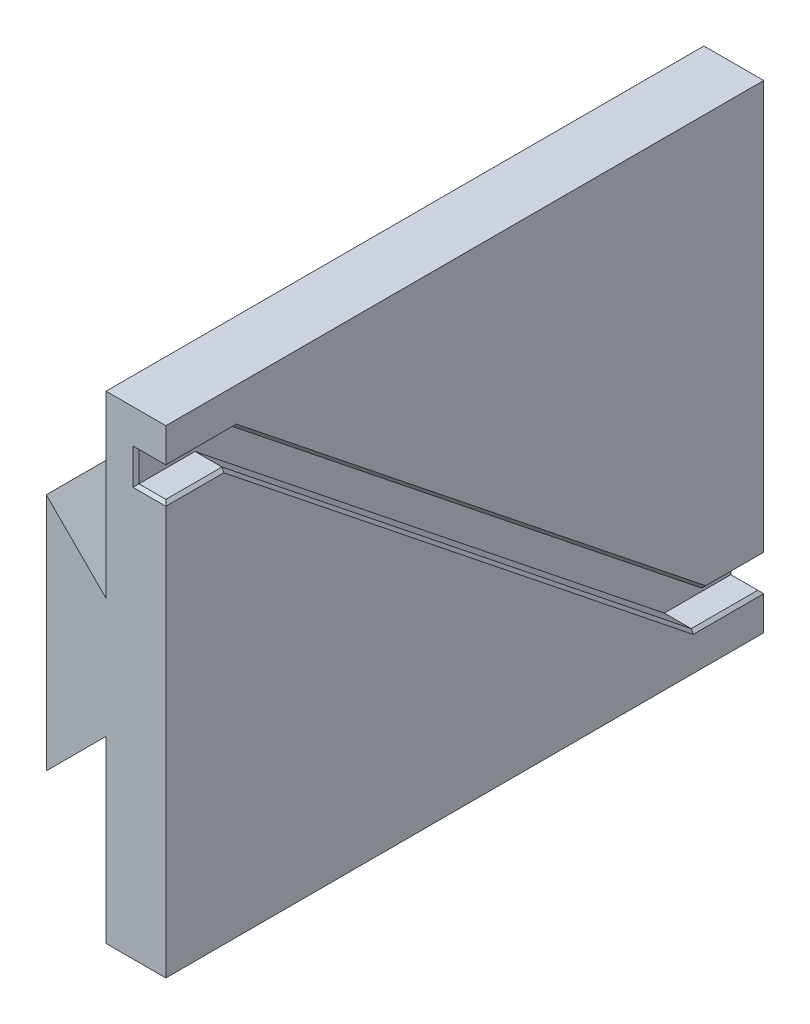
from build123d import *

# Parameters (mm, degrees)
BOSS_EXTRUDE1_DEPTH = 100
CUT_EXTRUDE1_DEPTH  = 10
CHAMFER1_SIZE       = 1


with BuildPart() as part:
    # Sketch1 → Boss-Extrude1 (new, symmetric)
    with BuildSketch(Plane.XY):
        Polygon((0, 80), (-20, 80), (-20, 20), (-40, 40), (-40, -40), (-20, -20), (-20, -80), (0, -80), align=None)
    extrude(amount=BOSS_EXTRUDE1_DEPTH, both=True)

    # Sketch2 → Cut-Extrude1 (cut)
    with BuildSketch(Plane(origin=(0, 0, 0), x_dir=(0, 0, -1), z_dir=(1, 0, 0))):
        Polygon((-100, 57.660237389), (-80.250855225, 57.660237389), (76.749144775, -67.660237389), (100, -67.660237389), (100, -57.660237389), (80.250855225, -57.660237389), (-76.749144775, 67.660237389), (-100, 67.660237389), align=None)
    extrude(amount=-CUT_EXTRUDE1_DEPTH, mode=Mode.SUBTRACT)

    # Chamfer1
    chamfer1_edges = [part.edges().sort_by_distance(p)[0] for p in [
        (-10, 62.660237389, 100),
        (-5, 57.660237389, 100),
        (-5, 67.660237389, 100),
        (-10, -62.660237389, -100),
        (-5, -57.660237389, -100),
        (-5, -67.660237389, -100),
        (0, 57.660237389, 90.125427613),
        (0, -5, 1.750855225),
        (0, -67.660237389, -88.374572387),
        (0, -57.660237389, -90.125427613),
        (0, 5, -1.750855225),
        (0, 67.660237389, 88.374572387),
    ]]
    chamfer(chamfer1_edges, length=CHAMFER1_SIZE)


solid = part.part
